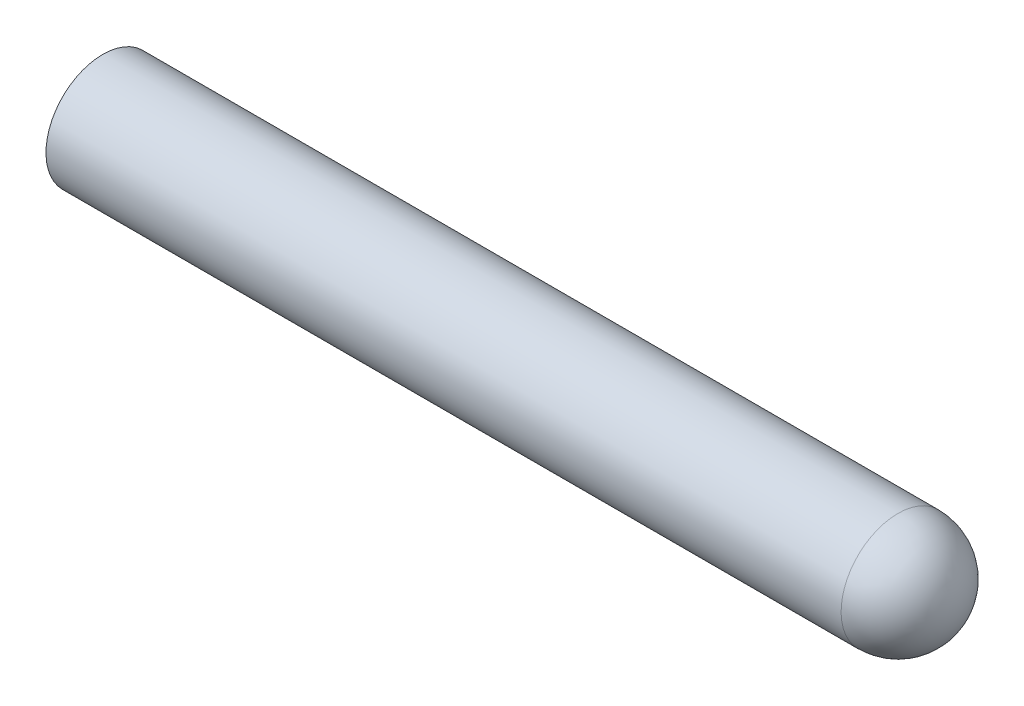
ISO-10303-21;
HEADER;
FILE_DESCRIPTION(('STEP AP214'),'2;1');
FILE_NAME('part.step','',(''),(''),'','','');
FILE_SCHEMA(('AUTOMOTIVE_DESIGN { 1 0 10303 214 1 1 1 1 }'));
ENDSEC;
DATA;
#1=APPLICATION_CONTEXT('core data for automotive mechanical design processes');
#2=APPLICATION_PROTOCOL_DEFINITION('international standard','automotive_design',2000,#1);
#3=PRODUCT_CONTEXT('',#1,'mechanical');
#4=PRODUCT('Part','Part','',(#3));
#5=PRODUCT_RELATED_PRODUCT_CATEGORY('part','',(#4));
#6=PRODUCT_DEFINITION_FORMATION('','',#4);
#7=PRODUCT_DEFINITION_CONTEXT('part definition',#1,'design');
#8=PRODUCT_DEFINITION('design','',#6,#7);
#9=PRODUCT_DEFINITION_SHAPE('','',#8);
#10=(LENGTH_UNIT() NAMED_UNIT(*) SI_UNIT(.MILLI.,.METRE.));
#11=(NAMED_UNIT(*) PLANE_ANGLE_UNIT() SI_UNIT($,.RADIAN.));
#12=(NAMED_UNIT(*) SI_UNIT($,.STERADIAN.) SOLID_ANGLE_UNIT());
#13=UNCERTAINTY_MEASURE_WITH_UNIT(LENGTH_MEASURE(1.E-05),#10,'distance_accuracy_value','');
#14=(GEOMETRIC_REPRESENTATION_CONTEXT(3) GLOBAL_UNCERTAINTY_ASSIGNED_CONTEXT((#13)) GLOBAL_UNIT_ASSIGNED_CONTEXT((#10,
#11,#12)) REPRESENTATION_CONTEXT('',''));
#15=CARTESIAN_POINT('',(0.,0.,0.));
#16=DIRECTION('',(0.,0.,1.));
#17=DIRECTION('',(1.,0.,0.));
#18=AXIS2_PLACEMENT_3D('',#15,#16,#17);
#19=CARTESIAN_POINT('',(0.,-10.,0.));
#20=DIRECTION('',(-1.,0.,0.));
#21=DIRECTION('',(0.,-1.,0.));
#22=AXIS2_PLACEMENT_3D('',#19,#20,#21);
#23=PLANE('',#22);
#24=CARTESIAN_POINT('',(0.,-10.,0.));
#25=DIRECTION('',(1.,0.,0.));
#26=DIRECTION('',(0.,1.,0.));
#27=AXIS2_PLACEMENT_3D('',#24,#25,#26);
#28=CIRCLE('',#27,10.);
#29=CARTESIAN_POINT('',(0.,0.,0.));
#30=VERTEX_POINT('',#29);
#31=EDGE_CURVE('E10',#30,#30,#28,.T.);
#32=ORIENTED_EDGE('',*,*,#31,.F.);
#33=EDGE_LOOP('',(#32));
#34=FACE_BOUND('',#33,.T.);
#35=ADVANCED_FACE('F29',(#34),#23,.T.);
#36=CARTESIAN_POINT('',(150.,-9.99999999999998,0.));
#37=DIRECTION('',(1.,0.,0.));
#38=DIRECTION('',(0.,1.,0.));
#39=AXIS2_PLACEMENT_3D('',#36,#37,#38);
#40=CYLINDRICAL_SURFACE('',#39,9.99999999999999);
#41=ORIENTED_EDGE('',*,*,#31,.T.);
#42=EDGE_LOOP('',(#41));
#43=FACE_BOUND('',#42,.T.);
#44=CARTESIAN_POINT('',(140.,-9.99999999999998,0.));
#45=DIRECTION('',(1.,0.,0.));
#46=DIRECTION('',(0.,1.,0.));
#47=AXIS2_PLACEMENT_3D('',#44,#45,#46);
#48=CIRCLE('',#47,9.99999999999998);
#49=CARTESIAN_POINT('',(140.,0.,0.));
#50=VERTEX_POINT('',#49);
#51=EDGE_CURVE('E35',#50,#50,#48,.T.);
#52=ORIENTED_EDGE('',*,*,#51,.F.);
#53=EDGE_LOOP('',(#52));
#54=FACE_BOUND('',#53,.T.);
#55=ADVANCED_FACE('F43',(#43,#54),#40,.T.);
#56=CARTESIAN_POINT('',(140.,-9.99999999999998,0.));
#57=DIRECTION('',(1.,0.,0.));
#58=DIRECTION('',(0.,1.,0.));
#59=AXIS2_PLACEMENT_3D('',#56,#57,#58);
#60=SPHERICAL_SURFACE('',#59,9.99999999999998);
#61=ORIENTED_EDGE('',*,*,#51,.T.);
#62=EDGE_LOOP('',(#61));
#63=FACE_BOUND('',#62,.T.);
#64=ADVANCED_FACE('F41',(#63),#60,.T.);
#65=CLOSED_SHELL('',(#35,#55,#64));
#66=MANIFOLD_SOLID_BREP('B2',#65);
#67=ADVANCED_BREP_SHAPE_REPRESENTATION('',(#18,#66),#14);
#68=SHAPE_DEFINITION_REPRESENTATION(#9,#67);
ENDSEC;
END-ISO-10303-21;
